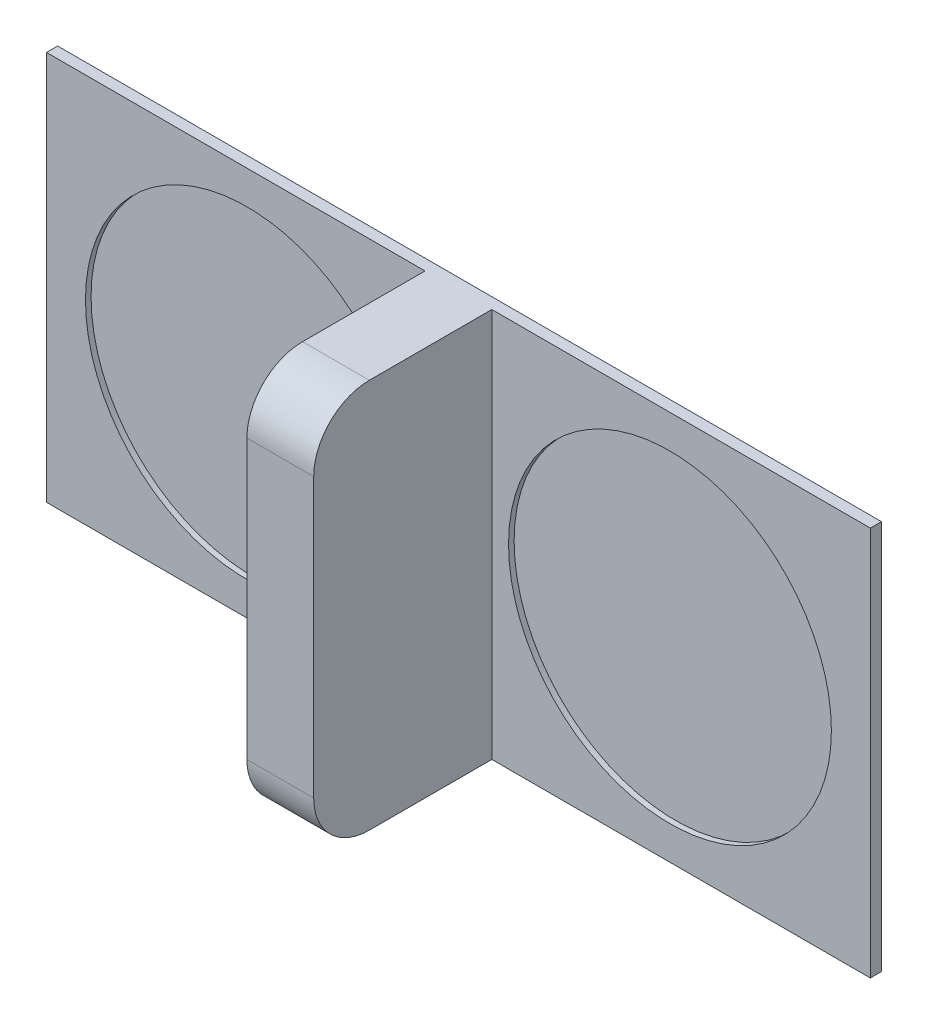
from build123d import *

# Parameters (mm, degrees)
SKETCH1_W           = 18.796
SKETCH1_H           = 8.89
BASE_EXTRUDE_DEPTH  = 0.254
SKETCH2_R           = 3.683
CUT_EXTRUDE1_DEPTH  = 0.127
SKETCH3_W           = 1.524
SKETCH3_H           = 8.89
BOSS_EXTRUDE1_DEPTH = 4.064
FILLET1_R           = 1.27


with BuildPart() as part:
    # Sketch1 → Base-Extrude (new body)
    with BuildSketch(Plane.XY):
        with Locations((-30.242405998, -2.483604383)):
            Rectangle(SKETCH1_W, SKETCH1_H)
    extrude(amount=BASE_EXTRUDE_DEPTH)

    # Sketch2 → Cut-Extrude1 (cut)
    with BuildSketch(Plane.XY.offset(0.254)):
        with Locations((-35.068405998, -2.483604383)):
            Circle(SKETCH2_R)
        with Locations((-25.416405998, -2.483604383)):
            Circle(SKETCH2_R)
    extrude(amount=-CUT_EXTRUDE1_DEPTH, mode=Mode.SUBTRACT)

    # Sketch3 → Boss-Extrude1 (add)
    with BuildSketch(Plane.XY.offset(0.254)):
        with Locations((-30.242405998, -2.483604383)):
            Rectangle(SKETCH3_W, SKETCH3_H)
    extrude(amount=BOSS_EXTRUDE1_DEPTH)

    # Fillet1
    fillet1_edges = [part.edges().sort_by_distance(p)[0] for p in [
        (-30.242405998, 1.961395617, 4.318),
        (-30.242405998, -6.928604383, 4.318),
    ]]
    fillet(fillet1_edges, radius=FILLET1_R)


solid = part.part
